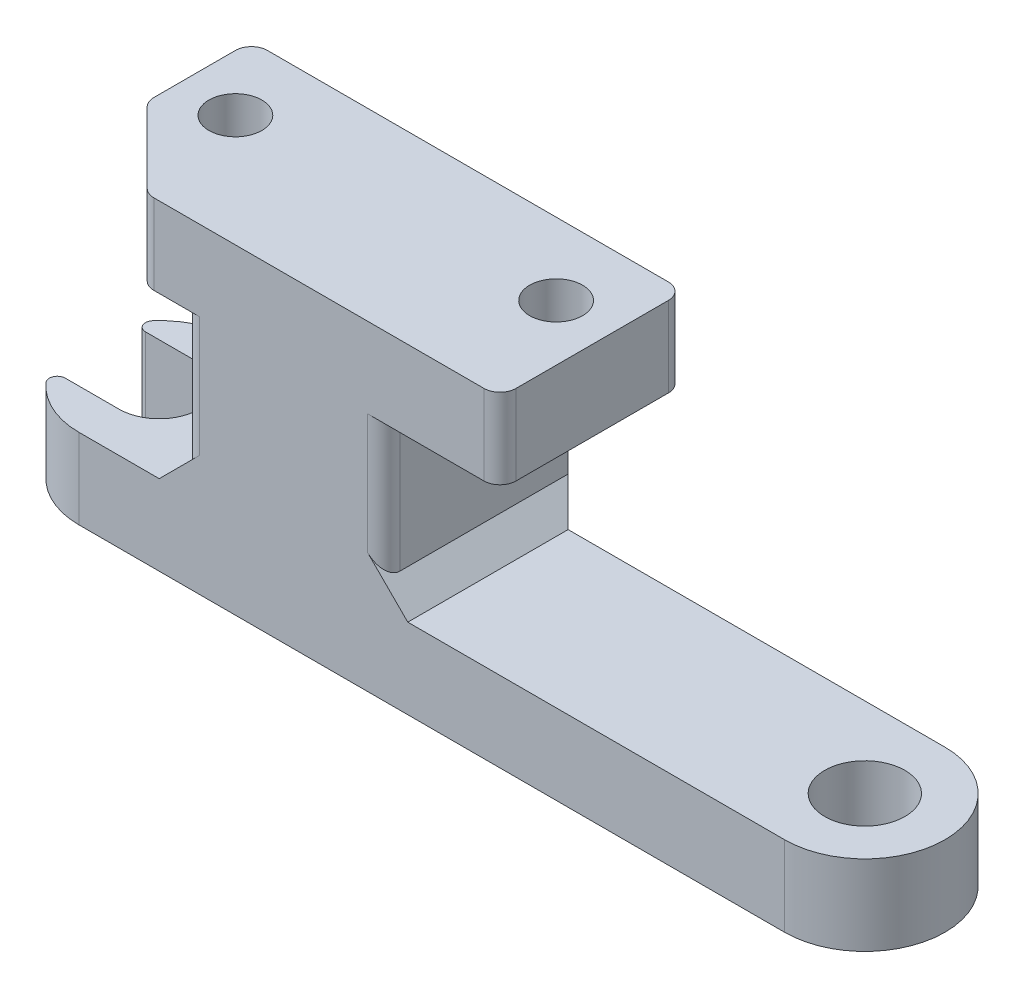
ISO-10303-21;
HEADER;
FILE_DESCRIPTION(('STEP AP214'),'2;1');
FILE_NAME('part.step','',(''),(''),'','','');
FILE_SCHEMA(('AUTOMOTIVE_DESIGN { 1 0 10303 214 1 1 1 1 }'));
ENDSEC;
DATA;
#1=APPLICATION_CONTEXT('core data for automotive mechanical design processes');
#2=APPLICATION_PROTOCOL_DEFINITION('international standard','automotive_design',2000,#1);
#3=PRODUCT_CONTEXT('',#1,'mechanical');
#4=PRODUCT('Part','Part','',(#3));
#5=PRODUCT_RELATED_PRODUCT_CATEGORY('part','',(#4));
#6=PRODUCT_DEFINITION_FORMATION('','',#4);
#7=PRODUCT_DEFINITION_CONTEXT('part definition',#1,'design');
#8=PRODUCT_DEFINITION('design','',#6,#7);
#9=PRODUCT_DEFINITION_SHAPE('','',#8);
#10=(LENGTH_UNIT() NAMED_UNIT(*) SI_UNIT(.MILLI.,.METRE.));
#11=(NAMED_UNIT(*) PLANE_ANGLE_UNIT() SI_UNIT($,.RADIAN.));
#12=(NAMED_UNIT(*) SI_UNIT($,.STERADIAN.) SOLID_ANGLE_UNIT());
#13=UNCERTAINTY_MEASURE_WITH_UNIT(LENGTH_MEASURE(1.E-05),#10,'distance_accuracy_value','');
#14=(GEOMETRIC_REPRESENTATION_CONTEXT(3) GLOBAL_UNCERTAINTY_ASSIGNED_CONTEXT((#13)) GLOBAL_UNIT_ASSIGNED_CONTEXT((#10,
#11,#12)) REPRESENTATION_CONTEXT('',''));
#15=CARTESIAN_POINT('',(0.,0.,0.));
#16=DIRECTION('',(0.,0.,1.));
#17=DIRECTION('',(1.,0.,0.));
#18=AXIS2_PLACEMENT_3D('',#15,#16,#17);
#19=CARTESIAN_POINT('',(0.,0.,0.));
#20=DIRECTION('',(0.,1.,0.));
#21=DIRECTION('',(0.,0.,1.));
#22=AXIS2_PLACEMENT_3D('',#19,#20,#21);
#23=PLANE('',#22);
#24=CARTESIAN_POINT('',(20.,0.,0.));
#25=DIRECTION('',(0.,1.,0.));
#26=DIRECTION('',(0.,0.,1.));
#27=AXIS2_PLACEMENT_3D('',#24,#25,#26);
#28=CIRCLE('',#27,3.3);
#29=CARTESIAN_POINT('',(20.,0.,3.3));
#30=VERTEX_POINT('',#29);
#31=EDGE_CURVE('E353',#30,#30,#28,.T.);
#32=ORIENTED_EDGE('',*,*,#31,.T.);
#33=EDGE_LOOP('',(#32));
#34=FACE_BOUND('',#33,.T.);
#35=DIRECTION('',(0.,0.,-1.));
#36=VECTOR('',#35,1.);
#37=CARTESIAN_POINT('',(27.,0.,-9.));
#38=LINE('',#37,#36);
#39=CARTESIAN_POINT('',(27.,0.,12.));
#40=VERTEX_POINT('',#39);
#41=CARTESIAN_POINT('',(27.,0.,-7.));
#42=VERTEX_POINT('',#41);
#43=EDGE_CURVE('E356',#40,#42,#38,.T.);
#44=ORIENTED_EDGE('',*,*,#43,.F.);
#45=CARTESIAN_POINT('',(25.,0.,12.));
#46=DIRECTION('',(0.,1.,0.));
#47=DIRECTION('',(0.,0.,1.));
#48=AXIS2_PLACEMENT_3D('',#45,#46,#47);
#49=CIRCLE('',#48,2.);
#50=CARTESIAN_POINT('',(25.,0.,14.));
#51=VERTEX_POINT('',#50);
#52=EDGE_CURVE('E459',#40,#51,#49,.F.);
#53=ORIENTED_EDGE('',*,*,#52,.T.);
#54=DIRECTION('',(1.,0.,0.));
#55=VECTOR('',#54,1.);
#56=CARTESIAN_POINT('',(12.5,0.,14.));
#57=LINE('',#56,#55);
#58=CARTESIAN_POINT('',(10.5,0.,14.));
#59=VERTEX_POINT('',#58);
#60=EDGE_CURVE('E322',#59,#51,#57,.T.);
#61=ORIENTED_EDGE('',*,*,#60,.F.);
#62=CARTESIAN_POINT('',(10.5,0.,12.));
#63=DIRECTION('',(0.,1.,0.));
#64=DIRECTION('',(0.,0.,1.));
#65=AXIS2_PLACEMENT_3D('',#62,#63,#64);
#66=CIRCLE('',#65,2.);
#67=CARTESIAN_POINT('',(12.5,0.,12.));
#68=VERTEX_POINT('',#67);
#69=EDGE_CURVE('E466',#59,#68,#66,.T.);
#70=ORIENTED_EDGE('',*,*,#69,.T.);
#71=DIRECTION('',(0.,0.,1.));
#72=VECTOR('',#71,1.);
#73=CARTESIAN_POINT('',(12.5,0.,-48.0512483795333));
#74=LINE('',#73,#72);
#75=CARTESIAN_POINT('',(12.5,0.,-9.));
#76=VERTEX_POINT('',#75);
#77=EDGE_CURVE('E327',#76,#68,#74,.T.);
#78=ORIENTED_EDGE('',*,*,#77,.F.);
#79=DIRECTION('',(-1.,0.,0.));
#80=VECTOR('',#79,1.);
#81=CARTESIAN_POINT('',(-27.,0.,-9.));
#82=LINE('',#81,#80);
#83=CARTESIAN_POINT('',(25.,0.,-9.));
#84=VERTEX_POINT('',#83);
#85=EDGE_CURVE('E371',#84,#76,#82,.T.);
#86=ORIENTED_EDGE('',*,*,#85,.F.);
#87=CARTESIAN_POINT('',(25.,0.,-7.));
#88=DIRECTION('',(0.,1.,0.));
#89=DIRECTION('',(0.,0.,1.));
#90=AXIS2_PLACEMENT_3D('',#87,#88,#89);
#91=CIRCLE('',#90,2.);
#92=EDGE_CURVE('E457',#84,#42,#91,.F.);
#93=ORIENTED_EDGE('',*,*,#92,.T.);
#94=EDGE_LOOP('',(#44,#53,#61,#70,#78,#86,#93));
#95=FACE_BOUND('',#94,.T.);
#96=ADVANCED_FACE('F41',(#34,#95),#23,.F.);
#97=CARTESIAN_POINT('',(27.,10.,-9.));
#98=DIRECTION('',(-1.,0.,0.));
#99=DIRECTION('',(0.,0.,1.));
#100=AXIS2_PLACEMENT_3D('',#97,#98,#99);
#101=PLANE('',#100);
#102=DIRECTION('',(0.,0.,-1.));
#103=VECTOR('',#102,1.);
#104=CARTESIAN_POINT('',(27.,10.,-9.));
#105=LINE('',#104,#103);
#106=CARTESIAN_POINT('',(27.,10.,12.));
#107=VERTEX_POINT('',#106);
#108=CARTESIAN_POINT('',(27.,10.,-7.));
#109=VERTEX_POINT('',#108);
#110=EDGE_CURVE('E357',#107,#109,#105,.T.);
#111=ORIENTED_EDGE('',*,*,#110,.F.);
#112=DIRECTION('',(0.,1.,0.));
#113=VECTOR('',#112,1.);
#114=CARTESIAN_POINT('',(27.,0.,12.));
#115=LINE('',#114,#113);
#116=EDGE_CURVE('E455',#107,#40,#115,.F.);
#117=ORIENTED_EDGE('',*,*,#116,.T.);
#118=ORIENTED_EDGE('',*,*,#43,.T.);
#119=DIRECTION('',(0.,-1.,0.));
#120=VECTOR('',#119,1.);
#121=CARTESIAN_POINT('',(27.,10.,-7.));
#122=LINE('',#121,#120);
#123=EDGE_CURVE('E453',#42,#109,#122,.F.);
#124=ORIENTED_EDGE('',*,*,#123,.T.);
#125=EDGE_LOOP('',(#111,#117,#118,#124));
#126=FACE_BOUND('',#125,.T.);
#127=ADVANCED_FACE('F535',(#126),#101,.F.);
#128=CARTESIAN_POINT('',(-27.,10.,-9.));
#129=DIRECTION('',(0.,0.,1.));
#130=DIRECTION('',(1.,0.,0.));
#131=AXIS2_PLACEMENT_3D('',#128,#129,#130);
#132=PLANE('',#131);
#133=CARTESIAN_POINT('',(-12.5,0.,-9.));
#134=VERTEX_POINT('',#133);
#135=CARTESIAN_POINT('',(-25.,0.,-9.));
#136=VERTEX_POINT('',#135);
#137=EDGE_CURVE('E370',#134,#136,#82,.T.);
#138=ORIENTED_EDGE('',*,*,#137,.T.);
#139=DIRECTION('',(0.,-1.,0.));
#140=VECTOR('',#139,1.);
#141=CARTESIAN_POINT('',(-25.,10.,-9.));
#142=LINE('',#141,#140);
#143=CARTESIAN_POINT('',(-25.,10.,-9.));
#144=VERTEX_POINT('',#143);
#145=EDGE_CURVE('E421',#136,#144,#142,.F.);
#146=ORIENTED_EDGE('',*,*,#145,.T.);
#147=DIRECTION('',(-1.,0.,0.));
#148=VECTOR('',#147,1.);
#149=CARTESIAN_POINT('',(-27.,10.,-9.));
#150=LINE('',#149,#148);
#151=CARTESIAN_POINT('',(25.,10.,-9.));
#152=VERTEX_POINT('',#151);
#153=EDGE_CURVE('E360',#152,#144,#150,.T.);
#154=ORIENTED_EDGE('',*,*,#153,.F.);
#155=DIRECTION('',(0.,-1.,0.));
#156=VECTOR('',#155,1.);
#157=CARTESIAN_POINT('',(25.,10.,-9.));
#158=LINE('',#157,#156);
#159=EDGE_CURVE('E418',#152,#84,#158,.T.);
#160=ORIENTED_EDGE('',*,*,#159,.T.);
#161=ORIENTED_EDGE('',*,*,#85,.T.);
#162=DIRECTION('',(0.,-1.,0.));
#163=VECTOR('',#162,1.);
#164=CARTESIAN_POINT('',(12.5,0.,-9.));
#165=LINE('',#164,#163);
#166=CARTESIAN_POINT('',(12.5,-17.,-9.));
#167=VERTEX_POINT('',#166);
#168=EDGE_CURVE('E341',#76,#167,#165,.T.);
#169=ORIENTED_EDGE('',*,*,#168,.T.);
#170=CARTESIAN_POINT('',(12.5,-30.,-9.));
#171=VERTEX_POINT('',#170);
#172=EDGE_CURVE('E335',#167,#171,#165,.T.);
#173=ORIENTED_EDGE('',*,*,#172,.T.);
#174=DIRECTION('',(-1.,0.,0.));
#175=VECTOR('',#174,1.);
#176=CARTESIAN_POINT('',(12.5,-30.,-9.));
#177=LINE('',#176,#175);
#178=CARTESIAN_POINT('',(-12.5,-30.,-9.));
#179=VERTEX_POINT('',#178);
#180=EDGE_CURVE('E331',#171,#179,#177,.T.);
#181=ORIENTED_EDGE('',*,*,#180,.T.);
#182=DIRECTION('',(0.,1.,0.));
#183=VECTOR('',#182,1.);
#184=CARTESIAN_POINT('',(-12.5,0.,-9.));
#185=LINE('',#184,#183);
#186=CARTESIAN_POINT('',(-12.5,-17.,-9.));
#187=VERTEX_POINT('',#186);
#188=EDGE_CURVE('E328',#179,#187,#185,.T.);
#189=ORIENTED_EDGE('',*,*,#188,.T.);
#190=EDGE_CURVE('E332',#187,#134,#185,.T.);
#191=ORIENTED_EDGE('',*,*,#190,.T.);
#192=EDGE_LOOP('',(#138,#146,#154,#160,#161,#169,#173,#181,#189,#191));
#193=FACE_BOUND('',#192,.T.);
#194=ADVANCED_FACE('F542',(#193),#132,.F.);
#195=CARTESIAN_POINT('',(-27.,10.,-9.));
#196=DIRECTION('',(1.,0.,0.));
#197=DIRECTION('',(0.,0.,-1.));
#198=AXIS2_PLACEMENT_3D('',#195,#196,#197);
#199=PLANE('',#198);
#200=DIRECTION('',(0.,0.,1.));
#201=VECTOR('',#200,1.);
#202=CARTESIAN_POINT('',(-27.,10.,-9.));
#203=LINE('',#202,#201);
#204=CARTESIAN_POINT('',(-27.,10.,-7.));
#205=VERTEX_POINT('',#204);
#206=CARTESIAN_POINT('',(-27.,10.,3.17157287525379));
#207=VERTEX_POINT('',#206);
#208=EDGE_CURVE('E364',#205,#207,#203,.T.);
#209=ORIENTED_EDGE('',*,*,#208,.F.);
#210=DIRECTION('',(0.,-1.,0.));
#211=VECTOR('',#210,1.);
#212=CARTESIAN_POINT('',(-27.,10.,-7.));
#213=LINE('',#212,#211);
#214=CARTESIAN_POINT('',(-27.,0.,-7.));
#215=VERTEX_POINT('',#214);
#216=EDGE_CURVE('E409',#205,#215,#213,.T.);
#217=ORIENTED_EDGE('',*,*,#216,.T.);
#218=DIRECTION('',(0.,0.,1.));
#219=VECTOR('',#218,1.);
#220=CARTESIAN_POINT('',(-27.,0.,-9.));
#221=LINE('',#220,#219);
#222=CARTESIAN_POINT('',(-27.,0.,3.17157287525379));
#223=VERTEX_POINT('',#222);
#224=EDGE_CURVE('E361',#215,#223,#221,.T.);
#225=ORIENTED_EDGE('',*,*,#224,.T.);
#226=DIRECTION('',(0.,1.,0.));
#227=VECTOR('',#226,1.);
#228=CARTESIAN_POINT('',(-27.,10.,3.17157287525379));
#229=LINE('',#228,#227);
#230=EDGE_CURVE('E400',#223,#207,#229,.T.);
#231=ORIENTED_EDGE('',*,*,#230,.T.);
#232=EDGE_LOOP('',(#209,#217,#225,#231));
#233=FACE_BOUND('',#232,.T.);
#234=ADVANCED_FACE('F559',(#233),#199,.F.);
#235=CARTESIAN_POINT('',(0.,10.,0.));
#236=DIRECTION('',(0.,1.,0.));
#237=DIRECTION('',(0.,0.,1.));
#238=AXIS2_PLACEMENT_3D('',#235,#236,#237);
#239=PLANE('',#238);
#240=CARTESIAN_POINT('',(-20.,10.,0.));
#241=DIRECTION('',(0.,1.,0.));
#242=DIRECTION('',(0.,0.,1.));
#243=AXIS2_PLACEMENT_3D('',#240,#241,#242);
#244=CIRCLE('',#243,3.3);
#245=CARTESIAN_POINT('',(-20.,10.,3.3));
#246=VERTEX_POINT('',#245);
#247=EDGE_CURVE('E344',#246,#246,#244,.T.);
#248=ORIENTED_EDGE('',*,*,#247,.F.);
#249=EDGE_LOOP('',(#248));
#250=FACE_BOUND('',#249,.T.);
#251=CARTESIAN_POINT('',(20.,10.,0.));
#252=DIRECTION('',(0.,1.,0.));
#253=DIRECTION('',(0.,0.,1.));
#254=AXIS2_PLACEMENT_3D('',#251,#252,#253);
#255=CIRCLE('',#254,3.3);
#256=CARTESIAN_POINT('',(20.,10.,3.3));
#257=VERTEX_POINT('',#256);
#258=EDGE_CURVE('E350',#257,#257,#255,.T.);
#259=ORIENTED_EDGE('',*,*,#258,.F.);
#260=EDGE_LOOP('',(#259));
#261=FACE_BOUND('',#260,.T.);
#262=ORIENTED_EDGE('',*,*,#153,.T.);
#263=CARTESIAN_POINT('',(-25.,10.,-7.));
#264=DIRECTION('',(0.,1.,0.));
#265=DIRECTION('',(0.,0.,1.));
#266=AXIS2_PLACEMENT_3D('',#263,#264,#265);
#267=CIRCLE('',#266,2.);
#268=EDGE_CURVE('E431',#144,#205,#267,.T.);
#269=ORIENTED_EDGE('',*,*,#268,.T.);
#270=ORIENTED_EDGE('',*,*,#208,.T.);
#271=CARTESIAN_POINT('',(-25.,10.,3.17157287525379));
#272=DIRECTION('',(0.,1.,0.));
#273=DIRECTION('',(0.,0.,1.));
#274=AXIS2_PLACEMENT_3D('',#271,#272,#273);
#275=CIRCLE('',#274,2.);
#276=CARTESIAN_POINT('',(-26.4142135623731,10.,4.58578643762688));
#277=VERTEX_POINT('',#276);
#278=EDGE_CURVE('E429',#207,#277,#275,.T.);
#279=ORIENTED_EDGE('',*,*,#278,.T.);
#280=DIRECTION('',(0.707106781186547,0.,0.707106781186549));
#281=VECTOR('',#280,1.);
#282=CARTESIAN_POINT('',(-15.5,10.,15.5));
#283=LINE('',#282,#281);
#284=CARTESIAN_POINT('',(-17.5857864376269,10.,13.4142135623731));
#285=VERTEX_POINT('',#284);
#286=EDGE_CURVE('E377',#277,#285,#283,.T.);
#287=ORIENTED_EDGE('',*,*,#286,.T.);
#288=CARTESIAN_POINT('',(-16.1715728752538,10.,12.));
#289=DIRECTION('',(0.,1.,0.));
#290=DIRECTION('',(0.,0.,1.));
#291=AXIS2_PLACEMENT_3D('',#288,#289,#290);
#292=CIRCLE('',#291,2.);
#293=CARTESIAN_POINT('',(-16.1715728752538,10.,14.));
#294=VERTEX_POINT('',#293);
#295=EDGE_CURVE('E427',#285,#294,#292,.T.);
#296=ORIENTED_EDGE('',*,*,#295,.T.);
#297=DIRECTION('',(-1.,0.,0.));
#298=VECTOR('',#297,1.);
#299=CARTESIAN_POINT('',(27.,10.,14.));
#300=LINE('',#299,#298);
#301=CARTESIAN_POINT('',(25.,10.,14.));
#302=VERTEX_POINT('',#301);
#303=EDGE_CURVE('E325',#302,#294,#300,.T.);
#304=ORIENTED_EDGE('',*,*,#303,.F.);
#305=CARTESIAN_POINT('',(25.,10.,12.));
#306=DIRECTION('',(0.,1.,0.));
#307=DIRECTION('',(0.,0.,1.));
#308=AXIS2_PLACEMENT_3D('',#305,#306,#307);
#309=CIRCLE('',#308,2.);
#310=EDGE_CURVE('E425',#302,#107,#309,.T.);
#311=ORIENTED_EDGE('',*,*,#310,.T.);
#312=ORIENTED_EDGE('',*,*,#110,.T.);
#313=CARTESIAN_POINT('',(25.,10.,-7.));
#314=DIRECTION('',(0.,1.,0.));
#315=DIRECTION('',(0.,0.,1.));
#316=AXIS2_PLACEMENT_3D('',#313,#314,#315);
#317=CIRCLE('',#316,2.);
#318=EDGE_CURVE('E423',#109,#152,#317,.T.);
#319=ORIENTED_EDGE('',*,*,#318,.T.);
#320=EDGE_LOOP('',(#262,#269,#270,#279,#287,#296,#304,#311,#312,#319));
#321=FACE_BOUND('',#320,.T.);
#322=ADVANCED_FACE('F550',(#250,#261,#321),#239,.T.);
#323=CARTESIAN_POINT('',(-20.,0.,0.));
#324=DIRECTION('',(0.,1.,0.));
#325=DIRECTION('',(0.,0.,1.));
#326=AXIS2_PLACEMENT_3D('',#323,#324,#325);
#327=CIRCLE('',#326,3.3);
#328=CARTESIAN_POINT('',(-20.,0.,3.3));
#329=VERTEX_POINT('',#328);
#330=EDGE_CURVE('E347',#329,#329,#327,.T.);
#331=ORIENTED_EDGE('',*,*,#330,.T.);
#332=EDGE_LOOP('',(#331));
#333=FACE_BOUND('',#332,.T.);
#334=ORIENTED_EDGE('',*,*,#224,.F.);
#335=CARTESIAN_POINT('',(-25.,0.,-7.));
#336=DIRECTION('',(0.,1.,0.));
#337=DIRECTION('',(0.,0.,1.));
#338=AXIS2_PLACEMENT_3D('',#335,#336,#337);
#339=CIRCLE('',#338,2.);
#340=EDGE_CURVE('E416',#215,#136,#339,.F.);
#341=ORIENTED_EDGE('',*,*,#340,.T.);
#342=ORIENTED_EDGE('',*,*,#137,.F.);
#343=DIRECTION('',(0.,0.,1.));
#344=VECTOR('',#343,1.);
#345=CARTESIAN_POINT('',(-12.5,0.,-48.0512483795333));
#346=LINE('',#345,#344);
#347=CARTESIAN_POINT('',(-12.5,0.,12.));
#348=VERTEX_POINT('',#347);
#349=EDGE_CURVE('E336',#134,#348,#346,.T.);
#350=ORIENTED_EDGE('',*,*,#349,.T.);
#351=CARTESIAN_POINT('',(-10.5,0.,12.));
#352=DIRECTION('',(0.,1.,0.));
#353=DIRECTION('',(0.,0.,1.));
#354=AXIS2_PLACEMENT_3D('',#351,#352,#353);
#355=CIRCLE('',#354,2.);
#356=CARTESIAN_POINT('',(-10.5,0.,14.));
#357=VERTEX_POINT('',#356);
#358=EDGE_CURVE('E463',#348,#357,#355,.T.);
#359=ORIENTED_EDGE('',*,*,#358,.T.);
#360=DIRECTION('',(1.,0.,0.));
#361=VECTOR('',#360,1.);
#362=CARTESIAN_POINT('',(-27.,0.,14.));
#363=LINE('',#362,#361);
#364=CARTESIAN_POINT('',(-16.1715728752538,0.,14.));
#365=VERTEX_POINT('',#364);
#366=EDGE_CURVE('E312',#365,#357,#363,.T.);
#367=ORIENTED_EDGE('',*,*,#366,.F.);
#368=CARTESIAN_POINT('',(-16.1715728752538,0.,12.));
#369=DIRECTION('',(0.,1.,0.));
#370=DIRECTION('',(0.,0.,1.));
#371=AXIS2_PLACEMENT_3D('',#368,#369,#370);
#372=CIRCLE('',#371,2.);
#373=CARTESIAN_POINT('',(-17.5857864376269,0.,13.4142135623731));
#374=VERTEX_POINT('',#373);
#375=EDGE_CURVE('E412',#365,#374,#372,.F.);
#376=ORIENTED_EDGE('',*,*,#375,.T.);
#377=DIRECTION('',(-0.707106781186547,0.,-0.707106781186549));
#378=VECTOR('',#377,1.);
#379=CARTESIAN_POINT('',(-17.,0.,14.));
#380=LINE('',#379,#378);
#381=CARTESIAN_POINT('',(-26.4142135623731,0.,4.58578643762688));
#382=VERTEX_POINT('',#381);
#383=EDGE_CURVE('E367',#374,#382,#380,.T.);
#384=ORIENTED_EDGE('',*,*,#383,.T.);
#385=CARTESIAN_POINT('',(-25.,0.,3.17157287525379));
#386=DIRECTION('',(0.,1.,0.));
#387=DIRECTION('',(0.,0.,1.));
#388=AXIS2_PLACEMENT_3D('',#385,#386,#387);
#389=CIRCLE('',#388,2.);
#390=EDGE_CURVE('E414',#382,#223,#389,.F.);
#391=ORIENTED_EDGE('',*,*,#390,.T.);
#392=EDGE_LOOP('',(#334,#341,#342,#350,#359,#367,#376,#384,#391));
#393=FACE_BOUND('',#392,.T.);
#394=ADVANCED_FACE('F538',(#333,#393),#23,.F.);
#395=CARTESIAN_POINT('',(20.,10.,0.));
#396=DIRECTION('',(0.,1.,0.));
#397=DIRECTION('',(0.,0.,1.));
#398=AXIS2_PLACEMENT_3D('',#395,#396,#397);
#399=CYLINDRICAL_SURFACE('',#398,3.3);
#400=ORIENTED_EDGE('',*,*,#31,.F.);
#401=EDGE_LOOP('',(#400));
#402=FACE_BOUND('',#401,.T.);
#403=ORIENTED_EDGE('',*,*,#258,.T.);
#404=EDGE_LOOP('',(#403));
#405=FACE_BOUND('',#404,.T.);
#406=ADVANCED_FACE('F549',(#402,#405),#399,.F.);
#407=CARTESIAN_POINT('',(-20.,10.,0.));
#408=DIRECTION('',(0.,1.,0.));
#409=DIRECTION('',(0.,0.,1.));
#410=AXIS2_PLACEMENT_3D('',#407,#408,#409);
#411=CYLINDRICAL_SURFACE('',#410,3.3);
#412=ORIENTED_EDGE('',*,*,#330,.F.);
#413=EDGE_LOOP('',(#412));
#414=FACE_BOUND('',#413,.T.);
#415=ORIENTED_EDGE('',*,*,#247,.T.);
#416=EDGE_LOOP('',(#415));
#417=FACE_BOUND('',#416,.T.);
#418=ADVANCED_FACE('F556',(#414,#417),#411,.F.);
#419=CARTESIAN_POINT('',(12.5,-30.,-48.0512483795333));
#420=DIRECTION('',(0.,-1.,0.));
#421=DIRECTION('',(1.,0.,0.));
#422=AXIS2_PLACEMENT_3D('',#419,#420,#421);
#423=PLANE('',#422);
#424=CARTESIAN_POINT('',(-25.5,-30.,4.));
#425=DIRECTION('',(0.,-1.,0.));
#426=DIRECTION('',(0.,0.,-1.));
#427=AXIS2_PLACEMENT_3D('',#424,#425,#426);
#428=CIRCLE('',#427,10.);
#429=CARTESIAN_POINT('',(-25.5,-30.,14.));
#430=VERTEX_POINT('',#429);
#431=CARTESIAN_POINT('',(-32.9535599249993,-30.,10.6666666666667));
#432=VERTEX_POINT('',#431);
#433=EDGE_CURVE('E275',#430,#432,#428,.T.);
#434=ORIENTED_EDGE('',*,*,#433,.T.);
#435=CARTESIAN_POINT('',(-32.2082039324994,-30.,10.));
#436=DIRECTION('',(0.,-1.,0.));
#437=DIRECTION('',(1.,0.,0.));
#438=AXIS2_PLACEMENT_3D('',#435,#436,#437);
#439=CIRCLE('',#438,1.);
#440=CARTESIAN_POINT('',(-32.2082039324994,-30.,9.));
#441=VERTEX_POINT('',#440);
#442=EDGE_CURVE('E476',#432,#441,#439,.T.);
#443=ORIENTED_EDGE('',*,*,#442,.T.);
#444=DIRECTION('',(1.,0.,0.));
#445=VECTOR('',#444,1.);
#446=CARTESIAN_POINT('',(-25.5,-30.,9.));
#447=LINE('',#446,#445);
#448=CARTESIAN_POINT('',(-25.5,-30.,9.));
#449=VERTEX_POINT('',#448);
#450=EDGE_CURVE('E298',#441,#449,#447,.T.);
#451=ORIENTED_EDGE('',*,*,#450,.T.);
#452=CARTESIAN_POINT('',(-25.5,-30.,4.));
#453=DIRECTION('',(0.,1.,0.));
#454=DIRECTION('',(0.,0.,-1.));
#455=AXIS2_PLACEMENT_3D('',#452,#453,#454);
#456=CIRCLE('',#455,5.);
#457=CARTESIAN_POINT('',(-25.5,-30.,-1.));
#458=VERTEX_POINT('',#457);
#459=EDGE_CURVE('E300',#449,#458,#456,.T.);
#460=ORIENTED_EDGE('',*,*,#459,.T.);
#461=DIRECTION('',(-1.,0.,0.));
#462=VECTOR('',#461,1.);
#463=CARTESIAN_POINT('',(-25.5,-30.,-1.));
#464=LINE('',#463,#462);
#465=CARTESIAN_POINT('',(-32.2082039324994,-30.,-1.00000000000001));
#466=VERTEX_POINT('',#465);
#467=EDGE_CURVE('E303',#458,#466,#464,.T.);
#468=ORIENTED_EDGE('',*,*,#467,.T.);
#469=CARTESIAN_POINT('',(-32.2082039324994,-30.,-2.00000000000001));
#470=DIRECTION('',(0.,-1.,0.));
#471=DIRECTION('',(1.,0.,0.));
#472=AXIS2_PLACEMENT_3D('',#469,#470,#471);
#473=CIRCLE('',#472,1.);
#474=CARTESIAN_POINT('',(-32.9535599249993,-30.,-2.66666666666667));
#475=VERTEX_POINT('',#474);
#476=EDGE_CURVE('E474',#466,#475,#473,.T.);
#477=ORIENTED_EDGE('',*,*,#476,.T.);
#478=CARTESIAN_POINT('',(-25.5,-30.,4.));
#479=DIRECTION('',(0.,-1.,0.));
#480=DIRECTION('',(0.,0.,1.));
#481=AXIS2_PLACEMENT_3D('',#478,#479,#480);
#482=CIRCLE('',#481,10.);
#483=CARTESIAN_POINT('',(-25.5,-30.,-6.00000000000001));
#484=VERTEX_POINT('',#483);
#485=EDGE_CURVE('E306',#475,#484,#482,.T.);
#486=ORIENTED_EDGE('',*,*,#485,.T.);
#487=DIRECTION('',(1.,0.,0.));
#488=VECTOR('',#487,1.);
#489=CARTESIAN_POINT('',(-12.5,-30.,-6.));
#490=LINE('',#489,#488);
#491=CARTESIAN_POINT('',(-15.5,-30.,-6.));
#492=VERTEX_POINT('',#491);
#493=EDGE_CURVE('E281',#484,#492,#490,.T.);
#494=ORIENTED_EDGE('',*,*,#493,.T.);
#495=DIRECTION('',(-0.707106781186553,0.,0.707106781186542));
#496=VECTOR('',#495,1.);
#497=CARTESIAN_POINT('',(-15.5,-30.,-6.));
#498=LINE('',#497,#496);
#499=EDGE_CURVE('E394',#492,#179,#498,.F.);
#500=ORIENTED_EDGE('',*,*,#499,.T.);
#501=ORIENTED_EDGE('',*,*,#180,.F.);
#502=DIRECTION('',(-0.707106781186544,0.,-0.707106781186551));
#503=VECTOR('',#502,1.);
#504=CARTESIAN_POINT('',(12.5,-30.,-9.00000000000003));
#505=LINE('',#504,#503);
#506=CARTESIAN_POINT('',(15.5,-30.,-6.));
#507=VERTEX_POINT('',#506);
#508=EDGE_CURVE('E398',#171,#507,#505,.F.);
#509=ORIENTED_EDGE('',*,*,#508,.T.);
#510=DIRECTION('',(1.,0.,0.));
#511=VECTOR('',#510,1.);
#512=CARTESIAN_POINT('',(12.5,-30.,-6.));
#513=LINE('',#512,#511);
#514=CARTESIAN_POINT('',(62.5,-30.,-5.99999999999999));
#515=VERTEX_POINT('',#514);
#516=EDGE_CURVE('E266',#507,#515,#513,.T.);
#517=ORIENTED_EDGE('',*,*,#516,.T.);
#518=CARTESIAN_POINT('',(62.5,-30.,4.00000000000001));
#519=DIRECTION('',(0.,-1.,0.));
#520=DIRECTION('',(0.,0.,-1.));
#521=AXIS2_PLACEMENT_3D('',#518,#519,#520);
#522=CIRCLE('',#521,10.);
#523=CARTESIAN_POINT('',(62.5,-30.,14.));
#524=VERTEX_POINT('',#523);
#525=EDGE_CURVE('E264',#515,#524,#522,.T.);
#526=ORIENTED_EDGE('',*,*,#525,.T.);
#527=DIRECTION('',(1.,0.,0.));
#528=VECTOR('',#527,1.);
#529=CARTESIAN_POINT('',(-12.5,-30.,14.));
#530=LINE('',#529,#528);
#531=EDGE_CURVE('E245',#430,#524,#530,.T.);
#532=ORIENTED_EDGE('',*,*,#531,.F.);
#533=EDGE_LOOP('',(#434,#443,#451,#460,#468,#477,#486,#494,#500,#501,#509,#517,#526,#532));
#534=FACE_BOUND('',#533,.T.);
#535=CARTESIAN_POINT('',(62.5,-30.,4.));
#536=DIRECTION('',(0.,-1.,0.));
#537=DIRECTION('',(0.,0.,-1.));
#538=AXIS2_PLACEMENT_3D('',#535,#536,#537);
#539=CIRCLE('',#538,5.);
#540=CARTESIAN_POINT('',(62.5,-30.,-1.));
#541=VERTEX_POINT('',#540);
#542=EDGE_CURVE('E269',#541,#541,#539,.T.);
#543=ORIENTED_EDGE('',*,*,#542,.F.);
#544=EDGE_LOOP('',(#543));
#545=FACE_BOUND('',#544,.T.);
#546=ADVANCED_FACE('F489',(#534,#545),#423,.T.);
#547=CARTESIAN_POINT('',(-12.5,0.,-48.0512483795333));
#548=DIRECTION('',(-1.,0.,0.));
#549=DIRECTION('',(0.,-1.,0.));
#550=AXIS2_PLACEMENT_3D('',#547,#548,#549);
#551=PLANE('',#550);
#552=DIRECTION('',(0.,0.,1.));
#553=VECTOR('',#552,1.);
#554=CARTESIAN_POINT('',(-12.5,-17.,-48.0512483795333));
#555=LINE('',#554,#553);
#556=CARTESIAN_POINT('',(-12.5,-17.,12.));
#557=VERTEX_POINT('',#556);
#558=EDGE_CURVE('E380',#187,#557,#555,.T.);
#559=ORIENTED_EDGE('',*,*,#558,.T.);
#560=DIRECTION('',(0.,-1.,0.));
#561=VECTOR('',#560,1.);
#562=CARTESIAN_POINT('',(-12.5,0.,12.));
#563=LINE('',#562,#561);
#564=EDGE_CURVE('E449',#557,#348,#563,.F.);
#565=ORIENTED_EDGE('',*,*,#564,.T.);
#566=ORIENTED_EDGE('',*,*,#349,.F.);
#567=ORIENTED_EDGE('',*,*,#190,.F.);
#568=EDGE_LOOP('',(#559,#565,#566,#567));
#569=FACE_BOUND('',#568,.T.);
#570=ADVANCED_FACE('F701',(#569),#551,.T.);
#571=CARTESIAN_POINT('',(12.5,0.,-48.0512483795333));
#572=DIRECTION('',(1.,0.,0.));
#573=DIRECTION('',(0.,1.,0.));
#574=AXIS2_PLACEMENT_3D('',#571,#572,#573);
#575=PLANE('',#574);
#576=ORIENTED_EDGE('',*,*,#77,.T.);
#577=DIRECTION('',(0.,1.,0.));
#578=VECTOR('',#577,1.);
#579=CARTESIAN_POINT('',(12.5,0.,12.));
#580=LINE('',#579,#578);
#581=CARTESIAN_POINT('',(12.5,-17.,12.));
#582=VERTEX_POINT('',#581);
#583=EDGE_CURVE('E451',#68,#582,#580,.F.);
#584=ORIENTED_EDGE('',*,*,#583,.T.);
#585=DIRECTION('',(0.,0.,-1.));
#586=VECTOR('',#585,1.);
#587=CARTESIAN_POINT('',(12.5,-17.,-6.));
#588=LINE('',#587,#586);
#589=EDGE_CURVE('E387',#582,#167,#588,.T.);
#590=ORIENTED_EDGE('',*,*,#589,.T.);
#591=ORIENTED_EDGE('',*,*,#168,.F.);
#592=EDGE_LOOP('',(#576,#584,#590,#591));
#593=FACE_BOUND('',#592,.T.);
#594=ADVANCED_FACE('F715',(#593),#575,.T.);
#595=CARTESIAN_POINT('',(0.,0.,14.));
#596=DIRECTION('',(0.,0.,1.));
#597=DIRECTION('',(1.,0.,0.));
#598=AXIS2_PLACEMENT_3D('',#595,#596,#597);
#599=PLANE('',#598);
#600=ORIENTED_EDGE('',*,*,#303,.T.);
#601=DIRECTION('',(0.,-1.,0.));
#602=VECTOR('',#601,1.);
#603=CARTESIAN_POINT('',(-16.1715728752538,0.,14.));
#604=LINE('',#603,#602);
#605=EDGE_CURVE('E446',#294,#365,#604,.T.);
#606=ORIENTED_EDGE('',*,*,#605,.T.);
#607=ORIENTED_EDGE('',*,*,#366,.T.);
#608=DIRECTION('',(0.,-1.,0.));
#609=VECTOR('',#608,1.);
#610=CARTESIAN_POINT('',(-10.5,0.,14.));
#611=LINE('',#610,#609);
#612=CARTESIAN_POINT('',(-10.5,-15.0000000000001,14.));
#613=VERTEX_POINT('',#612);
#614=EDGE_CURVE('E443',#357,#613,#611,.T.);
#615=ORIENTED_EDGE('',*,*,#614,.T.);
#616=DIRECTION('',(-0.707106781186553,-0.707106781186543,0.));
#617=VECTOR('',#616,1.);
#618=CARTESIAN_POINT('',(-12.5,-17.,14.));
#619=LINE('',#618,#617);
#620=CARTESIAN_POINT('',(-15.5,-20.,14.));
#621=VERTEX_POINT('',#620);
#622=EDGE_CURVE('E392',#613,#621,#619,.T.);
#623=ORIENTED_EDGE('',*,*,#622,.T.);
#624=DIRECTION('',(-1.,0.,0.));
#625=VECTOR('',#624,1.);
#626=CARTESIAN_POINT('',(-12.5,-20.,14.));
#627=LINE('',#626,#625);
#628=CARTESIAN_POINT('',(-25.5,-20.,14.));
#629=VERTEX_POINT('',#628);
#630=EDGE_CURVE('E293',#621,#629,#627,.T.);
#631=ORIENTED_EDGE('',*,*,#630,.T.);
#632=DIRECTION('',(0.,-1.,0.));
#633=VECTOR('',#632,1.);
#634=CARTESIAN_POINT('',(-25.5,-20.,14.));
#635=LINE('',#634,#633);
#636=EDGE_CURVE('E310',#629,#430,#635,.T.);
#637=ORIENTED_EDGE('',*,*,#636,.T.);
#638=ORIENTED_EDGE('',*,*,#531,.T.);
#639=DIRECTION('',(0.,-1.,0.));
#640=VECTOR('',#639,1.);
#641=CARTESIAN_POINT('',(62.5,-20.,14.));
#642=LINE('',#641,#640);
#643=CARTESIAN_POINT('',(62.5,-20.,14.));
#644=VERTEX_POINT('',#643);
#645=EDGE_CURVE('E238',#644,#524,#642,.T.);
#646=ORIENTED_EDGE('',*,*,#645,.F.);
#647=DIRECTION('',(-1.,0.,0.));
#648=VECTOR('',#647,1.);
#649=CARTESIAN_POINT('',(12.5,-20.,14.));
#650=LINE('',#649,#648);
#651=CARTESIAN_POINT('',(15.5,-20.,14.));
#652=VERTEX_POINT('',#651);
#653=EDGE_CURVE('E242',#644,#652,#650,.T.);
#654=ORIENTED_EDGE('',*,*,#653,.T.);
#655=DIRECTION('',(0.707106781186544,-0.707106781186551,0.));
#656=VECTOR('',#655,1.);
#657=CARTESIAN_POINT('',(12.5,-17.,14.));
#658=LINE('',#657,#656);
#659=CARTESIAN_POINT('',(10.5,-15.,14.));
#660=VERTEX_POINT('',#659);
#661=EDGE_CURVE('E396',#652,#660,#658,.F.);
#662=ORIENTED_EDGE('',*,*,#661,.T.);
#663=DIRECTION('',(0.,1.,0.));
#664=VECTOR('',#663,1.);
#665=CARTESIAN_POINT('',(10.5,0.,14.));
#666=LINE('',#665,#664);
#667=EDGE_CURVE('E440',#660,#59,#666,.T.);
#668=ORIENTED_EDGE('',*,*,#667,.T.);
#669=ORIENTED_EDGE('',*,*,#60,.T.);
#670=DIRECTION('',(0.,1.,0.));
#671=VECTOR('',#670,1.);
#672=CARTESIAN_POINT('',(25.,10.,14.));
#673=LINE('',#672,#671);
#674=EDGE_CURVE('E437',#51,#302,#673,.T.);
#675=ORIENTED_EDGE('',*,*,#674,.T.);
#676=EDGE_LOOP('',(#600,#606,#607,#615,#623,#631,#637,#638,#646,#654,#662,#668,#669,#675));
#677=FACE_BOUND('',#676,.T.);
#678=ADVANCED_FACE('F241',(#677),#599,.T.);
#679=CARTESIAN_POINT('',(-25.5,-20.,4.));
#680=DIRECTION('',(0.,-1.,0.));
#681=DIRECTION('',(0.,0.,-1.));
#682=AXIS2_PLACEMENT_3D('',#679,#680,#681);
#683=CYLINDRICAL_SURFACE('',#682,10.);
#684=CARTESIAN_POINT('',(-25.5,-20.,4.));
#685=DIRECTION('',(0.,-1.,0.));
#686=DIRECTION('',(0.,0.,-1.));
#687=AXIS2_PLACEMENT_3D('',#684,#685,#686);
#688=CIRCLE('',#687,10.);
#689=CARTESIAN_POINT('',(-32.9535599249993,-20.,10.6666666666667));
#690=VERTEX_POINT('',#689);
#691=EDGE_CURVE('E277',#629,#690,#688,.T.);
#692=ORIENTED_EDGE('',*,*,#691,.T.);
#693=DIRECTION('',(0.,-1.,0.));
#694=VECTOR('',#693,1.);
#695=CARTESIAN_POINT('',(-32.9535599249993,-20.,10.6666666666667));
#696=LINE('',#695,#694);
#697=EDGE_CURVE('E471',#690,#432,#696,.T.);
#698=ORIENTED_EDGE('',*,*,#697,.T.);
#699=ORIENTED_EDGE('',*,*,#433,.F.);
#700=ORIENTED_EDGE('',*,*,#636,.F.);
#701=EDGE_LOOP('',(#692,#698,#699,#700));
#702=FACE_BOUND('',#701,.T.);
#703=ADVANCED_FACE('F508',(#702),#683,.T.);
#704=CARTESIAN_POINT('',(-12.5,-20.,-6.));
#705=DIRECTION('',(0.,0.,-1.));
#706=DIRECTION('',(-1.,0.,0.));
#707=AXIS2_PLACEMENT_3D('',#704,#705,#706);
#708=PLANE('',#707);
#709=DIRECTION('',(1.,0.,0.));
#710=VECTOR('',#709,1.);
#711=CARTESIAN_POINT('',(-12.5,-20.,-6.));
#712=LINE('',#711,#710);
#713=CARTESIAN_POINT('',(-25.5,-20.,-6.00000000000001));
#714=VERTEX_POINT('',#713);
#715=CARTESIAN_POINT('',(-15.5,-20.,-6.));
#716=VERTEX_POINT('',#715);
#717=EDGE_CURVE('E290',#714,#716,#712,.T.);
#718=ORIENTED_EDGE('',*,*,#717,.T.);
#719=DIRECTION('',(0.,-1.,0.));
#720=VECTOR('',#719,1.);
#721=CARTESIAN_POINT('',(-15.5,-30.,-6.));
#722=LINE('',#721,#720);
#723=EDGE_CURVE('E385',#716,#492,#722,.T.);
#724=ORIENTED_EDGE('',*,*,#723,.T.);
#725=ORIENTED_EDGE('',*,*,#493,.F.);
#726=DIRECTION('',(0.,-1.,0.));
#727=VECTOR('',#726,1.);
#728=CARTESIAN_POINT('',(-25.5,-20.,-6.00000000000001));
#729=LINE('',#728,#727);
#730=EDGE_CURVE('E313',#714,#484,#729,.T.);
#731=ORIENTED_EDGE('',*,*,#730,.F.);
#732=EDGE_LOOP('',(#718,#724,#725,#731));
#733=FACE_BOUND('',#732,.T.);
#734=ADVANCED_FACE('F525',(#733),#708,.T.);
#735=CARTESIAN_POINT('',(-25.5,-20.,4.));
#736=DIRECTION('',(0.,-1.,0.));
#737=DIRECTION('',(0.,0.,-1.));
#738=AXIS2_PLACEMENT_3D('',#735,#736,#737);
#739=CYLINDRICAL_SURFACE('',#738,10.);
#740=ORIENTED_EDGE('',*,*,#485,.F.);
#741=DIRECTION('',(0.,-1.,0.));
#742=VECTOR('',#741,1.);
#743=CARTESIAN_POINT('',(-32.9535599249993,-20.,-2.66666666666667));
#744=LINE('',#743,#742);
#745=CARTESIAN_POINT('',(-32.9535599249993,-20.,-2.66666666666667));
#746=VERTEX_POINT('',#745);
#747=EDGE_CURVE('E11',#475,#746,#744,.F.);
#748=ORIENTED_EDGE('',*,*,#747,.T.);
#749=CARTESIAN_POINT('',(-25.5,-20.,4.));
#750=DIRECTION('',(0.,-1.,0.));
#751=DIRECTION('',(0.,0.,1.));
#752=AXIS2_PLACEMENT_3D('',#749,#750,#751);
#753=CIRCLE('',#752,10.);
#754=EDGE_CURVE('E288',#746,#714,#753,.T.);
#755=ORIENTED_EDGE('',*,*,#754,.T.);
#756=ORIENTED_EDGE('',*,*,#730,.T.);
#757=EDGE_LOOP('',(#740,#748,#755,#756));
#758=FACE_BOUND('',#757,.T.);
#759=ADVANCED_FACE('F528',(#758),#739,.T.);
#760=CARTESIAN_POINT('',(-25.5,-20.,-1.));
#761=DIRECTION('',(0.,0.,1.));
#762=DIRECTION('',(1.,0.,0.));
#763=AXIS2_PLACEMENT_3D('',#760,#761,#762);
#764=PLANE('',#763);
#765=DIRECTION('',(-1.,0.,0.));
#766=VECTOR('',#765,1.);
#767=CARTESIAN_POINT('',(-25.5,-20.,-1.));
#768=LINE('',#767,#766);
#769=CARTESIAN_POINT('',(-25.5,-20.,-1.));
#770=VERTEX_POINT('',#769);
#771=CARTESIAN_POINT('',(-32.2082039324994,-20.,-1.00000000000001));
#772=VERTEX_POINT('',#771);
#773=EDGE_CURVE('E286',#770,#772,#768,.T.);
#774=ORIENTED_EDGE('',*,*,#773,.T.);
#775=DIRECTION('',(0.,-1.,0.));
#776=VECTOR('',#775,1.);
#777=CARTESIAN_POINT('',(-32.2082039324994,-20.,-1.00000000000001));
#778=LINE('',#777,#776);
#779=EDGE_CURVE('E49',#772,#466,#778,.T.);
#780=ORIENTED_EDGE('',*,*,#779,.T.);
#781=ORIENTED_EDGE('',*,*,#467,.F.);
#782=DIRECTION('',(0.,-1.,0.));
#783=VECTOR('',#782,1.);
#784=CARTESIAN_POINT('',(-25.5,-20.,-1.));
#785=LINE('',#784,#783);
#786=EDGE_CURVE('E316',#770,#458,#785,.T.);
#787=ORIENTED_EDGE('',*,*,#786,.F.);
#788=EDGE_LOOP('',(#774,#780,#781,#787));
#789=FACE_BOUND('',#788,.T.);
#790=ADVANCED_FACE('F486',(#789),#764,.T.);
#791=CARTESIAN_POINT('',(-25.5,-20.,4.));
#792=DIRECTION('',(0.,-1.,0.));
#793=DIRECTION('',(0.,0.,-1.));
#794=AXIS2_PLACEMENT_3D('',#791,#792,#793);
#795=CYLINDRICAL_SURFACE('',#794,5.);
#796=ORIENTED_EDGE('',*,*,#459,.F.);
#797=DIRECTION('',(0.,-1.,0.));
#798=VECTOR('',#797,1.);
#799=CARTESIAN_POINT('',(-25.5,-20.,9.));
#800=LINE('',#799,#798);
#801=CARTESIAN_POINT('',(-25.5,-20.,9.));
#802=VERTEX_POINT('',#801);
#803=EDGE_CURVE('E295',#802,#449,#800,.T.);
#804=ORIENTED_EDGE('',*,*,#803,.F.);
#805=CARTESIAN_POINT('',(-25.5,-20.,4.));
#806=DIRECTION('',(0.,1.,0.));
#807=DIRECTION('',(0.,0.,-1.));
#808=AXIS2_PLACEMENT_3D('',#805,#806,#807);
#809=CIRCLE('',#808,5.);
#810=EDGE_CURVE('E283',#802,#770,#809,.T.);
#811=ORIENTED_EDGE('',*,*,#810,.T.);
#812=ORIENTED_EDGE('',*,*,#786,.T.);
#813=EDGE_LOOP('',(#796,#804,#811,#812));
#814=FACE_BOUND('',#813,.T.);
#815=ADVANCED_FACE('F495',(#814),#795,.F.);
#816=CARTESIAN_POINT('',(-25.5,-20.,9.));
#817=DIRECTION('',(0.,0.,-1.));
#818=DIRECTION('',(-1.,0.,0.));
#819=AXIS2_PLACEMENT_3D('',#816,#817,#818);
#820=PLANE('',#819);
#821=ORIENTED_EDGE('',*,*,#450,.F.);
#822=DIRECTION('',(0.,-1.,0.));
#823=VECTOR('',#822,1.);
#824=CARTESIAN_POINT('',(-32.2082039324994,-20.,9.));
#825=LINE('',#824,#823);
#826=CARTESIAN_POINT('',(-32.2082039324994,-20.,9.));
#827=VERTEX_POINT('',#826);
#828=EDGE_CURVE('E478',#441,#827,#825,.F.);
#829=ORIENTED_EDGE('',*,*,#828,.T.);
#830=DIRECTION('',(1.,0.,0.));
#831=VECTOR('',#830,1.);
#832=CARTESIAN_POINT('',(-25.5,-20.,9.));
#833=LINE('',#832,#831);
#834=EDGE_CURVE('E280',#827,#802,#833,.T.);
#835=ORIENTED_EDGE('',*,*,#834,.T.);
#836=ORIENTED_EDGE('',*,*,#803,.T.);
#837=EDGE_LOOP('',(#821,#829,#835,#836));
#838=FACE_BOUND('',#837,.T.);
#839=ADVANCED_FACE('F653',(#838),#820,.T.);
#840=CARTESIAN_POINT('',(-25.5,-20.,4.));
#841=DIRECTION('',(0.,-1.,0.));
#842=DIRECTION('',(0.,0.,-1.));
#843=AXIS2_PLACEMENT_3D('',#840,#841,#842);
#844=PLANE('',#843);
#845=ORIENTED_EDGE('',*,*,#834,.F.);
#846=CARTESIAN_POINT('',(-32.2082039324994,-20.,10.));
#847=DIRECTION('',(0.,-1.,0.));
#848=DIRECTION('',(0.,0.,-1.));
#849=AXIS2_PLACEMENT_3D('',#846,#847,#848);
#850=CIRCLE('',#849,1.);
#851=EDGE_CURVE('E481',#827,#690,#850,.F.);
#852=ORIENTED_EDGE('',*,*,#851,.T.);
#853=ORIENTED_EDGE('',*,*,#691,.F.);
#854=ORIENTED_EDGE('',*,*,#630,.F.);
#855=DIRECTION('',(0.,0.,-1.));
#856=VECTOR('',#855,1.);
#857=CARTESIAN_POINT('',(-15.5,-20.,4.));
#858=LINE('',#857,#856);
#859=EDGE_CURVE('E383',#621,#716,#858,.T.);
#860=ORIENTED_EDGE('',*,*,#859,.T.);
#861=ORIENTED_EDGE('',*,*,#717,.F.);
#862=ORIENTED_EDGE('',*,*,#754,.F.);
#863=CARTESIAN_POINT('',(-32.2082039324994,-20.,-2.00000000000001));
#864=DIRECTION('',(0.,-1.,0.));
#865=DIRECTION('',(0.,0.,-1.));
#866=AXIS2_PLACEMENT_3D('',#863,#864,#865);
#867=CIRCLE('',#866,1.);
#868=EDGE_CURVE('E56',#746,#772,#867,.F.);
#869=ORIENTED_EDGE('',*,*,#868,.T.);
#870=ORIENTED_EDGE('',*,*,#773,.F.);
#871=ORIENTED_EDGE('',*,*,#810,.F.);
#872=EDGE_LOOP('',(#845,#852,#853,#854,#860,#861,#862,#869,#870,#871));
#873=FACE_BOUND('',#872,.T.);
#874=ADVANCED_FACE('F498',(#873),#844,.F.);
#875=CARTESIAN_POINT('',(62.5,-20.,4.00000000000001));
#876=DIRECTION('',(0.,-1.,0.));
#877=DIRECTION('',(0.,0.,-1.));
#878=AXIS2_PLACEMENT_3D('',#875,#876,#877);
#879=CYLINDRICAL_SURFACE('',#878,10.);
#880=ORIENTED_EDGE('',*,*,#525,.F.);
#881=DIRECTION('',(0.,-1.,0.));
#882=VECTOR('',#881,1.);
#883=CARTESIAN_POINT('',(62.5,-20.,-5.99999999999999));
#884=LINE('',#883,#882);
#885=CARTESIAN_POINT('',(62.5,-20.,-5.99999999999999));
#886=VERTEX_POINT('',#885);
#887=EDGE_CURVE('E250',#886,#515,#884,.T.);
#888=ORIENTED_EDGE('',*,*,#887,.F.);
#889=CARTESIAN_POINT('',(62.5,-20.,4.));
#890=DIRECTION('',(0.,-1.,0.));
#891=DIRECTION('',(0.,0.,1.));
#892=AXIS2_PLACEMENT_3D('',#889,#890,#891);
#893=CIRCLE('',#892,9.99999999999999);
#894=EDGE_CURVE('E257',#886,#644,#893,.T.);
#895=ORIENTED_EDGE('',*,*,#894,.T.);
#896=ORIENTED_EDGE('',*,*,#645,.T.);
#897=EDGE_LOOP('',(#880,#888,#895,#896));
#898=FACE_BOUND('',#897,.T.);
#899=ADVANCED_FACE('F262',(#898),#879,.T.);
#900=CARTESIAN_POINT('',(12.5,-20.,-6.));
#901=DIRECTION('',(0.,0.,-1.));
#902=DIRECTION('',(-1.,0.,0.));
#903=AXIS2_PLACEMENT_3D('',#900,#901,#902);
#904=PLANE('',#903);
#905=ORIENTED_EDGE('',*,*,#516,.F.);
#906=DIRECTION('',(0.,1.,0.));
#907=VECTOR('',#906,1.);
#908=CARTESIAN_POINT('',(15.5,-20.,-6.));
#909=LINE('',#908,#907);
#910=CARTESIAN_POINT('',(15.5,-20.,-6.));
#911=VERTEX_POINT('',#910);
#912=EDGE_CURVE('E390',#507,#911,#909,.T.);
#913=ORIENTED_EDGE('',*,*,#912,.T.);
#914=DIRECTION('',(1.,0.,0.));
#915=VECTOR('',#914,1.);
#916=CARTESIAN_POINT('',(12.5,-20.,-6.));
#917=LINE('',#916,#915);
#918=EDGE_CURVE('E251',#911,#886,#917,.T.);
#919=ORIENTED_EDGE('',*,*,#918,.T.);
#920=ORIENTED_EDGE('',*,*,#887,.T.);
#921=EDGE_LOOP('',(#905,#913,#919,#920));
#922=FACE_BOUND('',#921,.T.);
#923=ADVANCED_FACE('F898',(#922),#904,.T.);
#924=CARTESIAN_POINT('',(62.5,-20.,4.));
#925=DIRECTION('',(0.,1.,0.));
#926=DIRECTION('',(0.,0.,1.));
#927=AXIS2_PLACEMENT_3D('',#924,#925,#926);
#928=PLANE('',#927);
#929=CARTESIAN_POINT('',(62.5,-20.,4.));
#930=DIRECTION('',(0.,-1.,0.));
#931=DIRECTION('',(0.,0.,-1.));
#932=AXIS2_PLACEMENT_3D('',#929,#930,#931);
#933=CIRCLE('',#932,5.);
#934=CARTESIAN_POINT('',(62.5,-20.,-1.));
#935=VERTEX_POINT('',#934);
#936=EDGE_CURVE('E273',#935,#935,#933,.T.);
#937=ORIENTED_EDGE('',*,*,#936,.T.);
#938=EDGE_LOOP('',(#937));
#939=FACE_BOUND('',#938,.T.);
#940=ORIENTED_EDGE('',*,*,#918,.F.);
#941=DIRECTION('',(0.,0.,1.));
#942=VECTOR('',#941,1.);
#943=CARTESIAN_POINT('',(15.5,-20.,14.));
#944=LINE('',#943,#942);
#945=EDGE_CURVE('E260',#911,#652,#944,.T.);
#946=ORIENTED_EDGE('',*,*,#945,.T.);
#947=ORIENTED_EDGE('',*,*,#653,.F.);
#948=ORIENTED_EDGE('',*,*,#894,.F.);
#949=EDGE_LOOP('',(#940,#946,#947,#948));
#950=FACE_BOUND('',#949,.T.);
#951=ADVANCED_FACE('F256',(#939,#950),#928,.T.);
#952=CARTESIAN_POINT('',(62.5,-20.,4.));
#953=DIRECTION('',(0.,-1.,0.));
#954=DIRECTION('',(0.,0.,-1.));
#955=AXIS2_PLACEMENT_3D('',#952,#953,#954);
#956=CYLINDRICAL_SURFACE('',#955,5.);
#957=ORIENTED_EDGE('',*,*,#936,.F.);
#958=EDGE_LOOP('',(#957));
#959=FACE_BOUND('',#958,.T.);
#960=ORIENTED_EDGE('',*,*,#542,.T.);
#961=EDGE_LOOP('',(#960));
#962=FACE_BOUND('',#961,.T.);
#963=ADVANCED_FACE('F737',(#959,#962),#956,.F.);
#964=CARTESIAN_POINT('',(-17.,0.,14.));
#965=DIRECTION('',(-0.707106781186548,0.,0.707106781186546));
#966=DIRECTION('',(0.,1.,0.));
#967=AXIS2_PLACEMENT_3D('',#964,#965,#966);
#968=PLANE('',#967);
#969=ORIENTED_EDGE('',*,*,#286,.F.);
#970=DIRECTION('',(0.,1.,0.));
#971=VECTOR('',#970,1.);
#972=CARTESIAN_POINT('',(-26.4142135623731,0.,4.58578643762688));
#973=LINE('',#972,#971);
#974=EDGE_CURVE('E435',#277,#382,#973,.F.);
#975=ORIENTED_EDGE('',*,*,#974,.T.);
#976=ORIENTED_EDGE('',*,*,#383,.F.);
#977=DIRECTION('',(0.,-1.,0.));
#978=VECTOR('',#977,1.);
#979=CARTESIAN_POINT('',(-17.5857864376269,0.,13.4142135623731));
#980=LINE('',#979,#978);
#981=EDGE_CURVE('E433',#374,#285,#980,.F.);
#982=ORIENTED_EDGE('',*,*,#981,.T.);
#983=EDGE_LOOP('',(#969,#975,#976,#982));
#984=FACE_BOUND('',#983,.T.);
#985=ADVANCED_FACE('F578',(#984),#968,.T.);
#986=CARTESIAN_POINT('',(-15.5,-20.,-6.));
#987=DIRECTION('',(-0.707106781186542,0.,-0.707106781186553));
#988=DIRECTION('',(0.,1.,0.));
#989=AXIS2_PLACEMENT_3D('',#986,#987,#988);
#990=PLANE('',#989);
#991=ORIENTED_EDGE('',*,*,#499,.F.);
#992=ORIENTED_EDGE('',*,*,#723,.F.);
#993=DIRECTION('',(-0.577350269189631,-0.577350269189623,0.577350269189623));
#994=VECTOR('',#993,1.);
#995=CARTESIAN_POINT('',(-15.5,-20.,-6.));
#996=LINE('',#995,#994);
#997=EDGE_CURVE('E401',#187,#716,#996,.T.);
#998=ORIENTED_EDGE('',*,*,#997,.F.);
#999=ORIENTED_EDGE('',*,*,#188,.F.);
#1000=EDGE_LOOP('',(#991,#992,#998,#999));
#1001=FACE_BOUND('',#1000,.T.);
#1002=ADVANCED_FACE('F522',(#1001),#990,.T.);
#1003=CARTESIAN_POINT('',(-12.5,-17.,-48.0512483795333));
#1004=DIRECTION('',(0.707106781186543,-0.707106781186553,0.));
#1005=DIRECTION('',(0.,0.,1.));
#1006=AXIS2_PLACEMENT_3D('',#1003,#1004,#1005);
#1007=PLANE('',#1006);
#1008=ORIENTED_EDGE('',*,*,#997,.T.);
#1009=ORIENTED_EDGE('',*,*,#859,.F.);
#1010=ORIENTED_EDGE('',*,*,#622,.F.);
#1011=CARTESIAN_POINT('',(-10.5,-15.0000000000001,12.));
#1012=DIRECTION('',(0.707106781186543,-0.707106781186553,0.));
#1013=DIRECTION('',(-0.707106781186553,-0.707106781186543,0.));
#1014=AXIS2_PLACEMENT_3D('',#1011,#1012,#1013);
#1015=ELLIPSE('',#1014,2.82842712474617,2.);
#1016=EDGE_CURVE('E461',#613,#557,#1015,.T.);
#1017=ORIENTED_EDGE('',*,*,#1016,.T.);
#1018=ORIENTED_EDGE('',*,*,#558,.F.);
#1019=EDGE_LOOP('',(#1008,#1009,#1010,#1017,#1018));
#1020=FACE_BOUND('',#1019,.T.);
#1021=ADVANCED_FACE('F514',(#1020),#1007,.F.);
#1022=CARTESIAN_POINT('',(12.5,0.,-9.00000000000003));
#1023=DIRECTION('',(0.707106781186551,0.,-0.707106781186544));
#1024=DIRECTION('',(0.,1.,0.));
#1025=AXIS2_PLACEMENT_3D('',#1022,#1023,#1024);
#1026=PLANE('',#1025);
#1027=ORIENTED_EDGE('',*,*,#508,.F.);
#1028=ORIENTED_EDGE('',*,*,#172,.F.);
#1029=DIRECTION('',(0.577350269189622,-0.577350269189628,0.577350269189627));
#1030=VECTOR('',#1029,1.);
#1031=CARTESIAN_POINT('',(6.83333333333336,-11.3333333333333,-14.6666666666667));
#1032=LINE('',#1031,#1030);
#1033=EDGE_CURVE('E404',#911,#167,#1032,.F.);
#1034=ORIENTED_EDGE('',*,*,#1033,.F.);
#1035=ORIENTED_EDGE('',*,*,#912,.F.);
#1036=EDGE_LOOP('',(#1027,#1028,#1034,#1035));
#1037=FACE_BOUND('',#1036,.T.);
#1038=ADVANCED_FACE('F612',(#1037),#1026,.T.);
#1039=CARTESIAN_POINT('',(12.5,-17.,-48.0512483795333));
#1040=DIRECTION('',(0.707106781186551,0.707106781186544,0.));
#1041=DIRECTION('',(0.,0.,1.));
#1042=AXIS2_PLACEMENT_3D('',#1039,#1040,#1041);
#1043=PLANE('',#1042);
#1044=ORIENTED_EDGE('',*,*,#661,.F.);
#1045=ORIENTED_EDGE('',*,*,#945,.F.);
#1046=ORIENTED_EDGE('',*,*,#1033,.T.);
#1047=ORIENTED_EDGE('',*,*,#589,.F.);
#1048=CARTESIAN_POINT('',(10.5,-15.,12.));
#1049=DIRECTION('',(0.707106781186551,0.707106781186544,0.));
#1050=DIRECTION('',(-0.707106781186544,0.707106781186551,0.));
#1051=AXIS2_PLACEMENT_3D('',#1048,#1049,#1050);
#1052=ELLIPSE('',#1051,2.82842712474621,2.);
#1053=EDGE_CURVE('E468',#582,#660,#1052,.F.);
#1054=ORIENTED_EDGE('',*,*,#1053,.T.);
#1055=EDGE_LOOP('',(#1044,#1045,#1046,#1047,#1054));
#1056=FACE_BOUND('',#1055,.T.);
#1057=ADVANCED_FACE('F605',(#1056),#1043,.T.);
#1058=CARTESIAN_POINT('',(-25.,10.,-7.));
#1059=DIRECTION('',(0.,-1.,0.));
#1060=DIRECTION('',(0.,0.,-1.));
#1061=AXIS2_PLACEMENT_3D('',#1058,#1059,#1060);
#1062=CYLINDRICAL_SURFACE('',#1061,2.);
#1063=ORIENTED_EDGE('',*,*,#268,.F.);
#1064=ORIENTED_EDGE('',*,*,#145,.F.);
#1065=ORIENTED_EDGE('',*,*,#340,.F.);
#1066=ORIENTED_EDGE('',*,*,#216,.F.);
#1067=EDGE_LOOP('',(#1063,#1064,#1065,#1066));
#1068=FACE_BOUND('',#1067,.T.);
#1069=ADVANCED_FACE('F603',(#1068),#1062,.T.);
#1070=CARTESIAN_POINT('',(-25.,10.,3.17157287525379));
#1071=DIRECTION('',(0.,-1.,0.));
#1072=DIRECTION('',(0.,0.,-1.));
#1073=AXIS2_PLACEMENT_3D('',#1070,#1071,#1072);
#1074=CYLINDRICAL_SURFACE('',#1073,2.);
#1075=ORIENTED_EDGE('',*,*,#390,.F.);
#1076=ORIENTED_EDGE('',*,*,#974,.F.);
#1077=ORIENTED_EDGE('',*,*,#278,.F.);
#1078=ORIENTED_EDGE('',*,*,#230,.F.);
#1079=EDGE_LOOP('',(#1075,#1076,#1077,#1078));
#1080=FACE_BOUND('',#1079,.T.);
#1081=ADVANCED_FACE('F572',(#1080),#1074,.T.);
#1082=CARTESIAN_POINT('',(-16.1715728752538,0.,12.));
#1083=DIRECTION('',(0.,-1.,0.));
#1084=DIRECTION('',(0.,0.,-1.));
#1085=AXIS2_PLACEMENT_3D('',#1082,#1083,#1084);
#1086=CYLINDRICAL_SURFACE('',#1085,2.);
#1087=ORIENTED_EDGE('',*,*,#295,.F.);
#1088=ORIENTED_EDGE('',*,*,#981,.F.);
#1089=ORIENTED_EDGE('',*,*,#375,.F.);
#1090=ORIENTED_EDGE('',*,*,#605,.F.);
#1091=EDGE_LOOP('',(#1087,#1088,#1089,#1090));
#1092=FACE_BOUND('',#1091,.T.);
#1093=ADVANCED_FACE('F582',(#1092),#1086,.T.);
#1094=CARTESIAN_POINT('',(-10.5,0.,12.));
#1095=DIRECTION('',(0.,-1.,0.));
#1096=DIRECTION('',(1.,0.,0.));
#1097=AXIS2_PLACEMENT_3D('',#1094,#1095,#1096);
#1098=CYLINDRICAL_SURFACE('',#1097,2.);
#1099=ORIENTED_EDGE('',*,*,#358,.F.);
#1100=ORIENTED_EDGE('',*,*,#564,.F.);
#1101=ORIENTED_EDGE('',*,*,#1016,.F.);
#1102=ORIENTED_EDGE('',*,*,#614,.F.);
#1103=EDGE_LOOP('',(#1099,#1100,#1101,#1102));
#1104=FACE_BOUND('',#1103,.T.);
#1105=ADVANCED_FACE('F620',(#1104),#1098,.T.);
#1106=CARTESIAN_POINT('',(10.5,0.,12.));
#1107=DIRECTION('',(0.,1.,0.));
#1108=DIRECTION('',(-1.,0.,0.));
#1109=AXIS2_PLACEMENT_3D('',#1106,#1107,#1108);
#1110=CYLINDRICAL_SURFACE('',#1109,2.);
#1111=ORIENTED_EDGE('',*,*,#1053,.F.);
#1112=ORIENTED_EDGE('',*,*,#583,.F.);
#1113=ORIENTED_EDGE('',*,*,#69,.F.);
#1114=ORIENTED_EDGE('',*,*,#667,.F.);
#1115=EDGE_LOOP('',(#1111,#1112,#1113,#1114));
#1116=FACE_BOUND('',#1115,.T.);
#1117=ADVANCED_FACE('F623',(#1116),#1110,.T.);
#1118=CARTESIAN_POINT('',(25.,0.,12.));
#1119=DIRECTION('',(0.,-1.,0.));
#1120=DIRECTION('',(0.,0.,-1.));
#1121=AXIS2_PLACEMENT_3D('',#1118,#1119,#1120);
#1122=CYLINDRICAL_SURFACE('',#1121,2.);
#1123=ORIENTED_EDGE('',*,*,#52,.F.);
#1124=ORIENTED_EDGE('',*,*,#116,.F.);
#1125=ORIENTED_EDGE('',*,*,#310,.F.);
#1126=ORIENTED_EDGE('',*,*,#674,.F.);
#1127=EDGE_LOOP('',(#1123,#1124,#1125,#1126));
#1128=FACE_BOUND('',#1127,.T.);
#1129=ADVANCED_FACE('F589',(#1128),#1122,.T.);
#1130=CARTESIAN_POINT('',(25.,10.,-7.));
#1131=DIRECTION('',(0.,-1.,0.));
#1132=DIRECTION('',(0.,0.,-1.));
#1133=AXIS2_PLACEMENT_3D('',#1130,#1131,#1132);
#1134=CYLINDRICAL_SURFACE('',#1133,2.);
#1135=ORIENTED_EDGE('',*,*,#318,.F.);
#1136=ORIENTED_EDGE('',*,*,#123,.F.);
#1137=ORIENTED_EDGE('',*,*,#92,.F.);
#1138=ORIENTED_EDGE('',*,*,#159,.F.);
#1139=EDGE_LOOP('',(#1135,#1136,#1137,#1138));
#1140=FACE_BOUND('',#1139,.T.);
#1141=ADVANCED_FACE('F533',(#1140),#1134,.T.);
#1142=CARTESIAN_POINT('',(-32.2082039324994,-20.,10.));
#1143=DIRECTION('',(0.,-1.,0.));
#1144=DIRECTION('',(0.,0.,-1.));
#1145=AXIS2_PLACEMENT_3D('',#1142,#1143,#1144);
#1146=CYLINDRICAL_SURFACE('',#1145,1.);
#1147=ORIENTED_EDGE('',*,*,#851,.F.);
#1148=ORIENTED_EDGE('',*,*,#828,.F.);
#1149=ORIENTED_EDGE('',*,*,#442,.F.);
#1150=ORIENTED_EDGE('',*,*,#697,.F.);
#1151=EDGE_LOOP('',(#1147,#1148,#1149,#1150));
#1152=FACE_BOUND('',#1151,.T.);
#1153=ADVANCED_FACE('F505',(#1152),#1146,.T.);
#1154=CARTESIAN_POINT('',(-32.2082039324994,-20.,-2.00000000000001));
#1155=DIRECTION('',(0.,-1.,0.));
#1156=DIRECTION('',(0.,0.,-1.));
#1157=AXIS2_PLACEMENT_3D('',#1154,#1155,#1156);
#1158=CYLINDRICAL_SURFACE('',#1157,1.);
#1159=ORIENTED_EDGE('',*,*,#868,.F.);
#1160=ORIENTED_EDGE('',*,*,#747,.F.);
#1161=ORIENTED_EDGE('',*,*,#476,.F.);
#1162=ORIENTED_EDGE('',*,*,#779,.F.);
#1163=EDGE_LOOP('',(#1159,#1160,#1161,#1162));
#1164=FACE_BOUND('',#1163,.T.);
#1165=ADVANCED_FACE('F43',(#1164),#1158,.T.);
#1166=CLOSED_SHELL('',(#96,#127,#194,#234,#322,#394,#406,#418,#546,#570,#594,#678,#703,#734,
#759,#790,#815,#839,#874,#899,#923,#951,#963,#985,#1002,#1021,#1038,#1057,#1069,#1081,#1093,
#1105,#1117,#1129,#1141,#1153,#1165));
#1167=MANIFOLD_SOLID_BREP('B2',#1166);
#1168=ADVANCED_BREP_SHAPE_REPRESENTATION('',(#18,#1167),#14);
#1169=SHAPE_DEFINITION_REPRESENTATION(#9,#1168);
ENDSEC;
END-ISO-10303-21;
